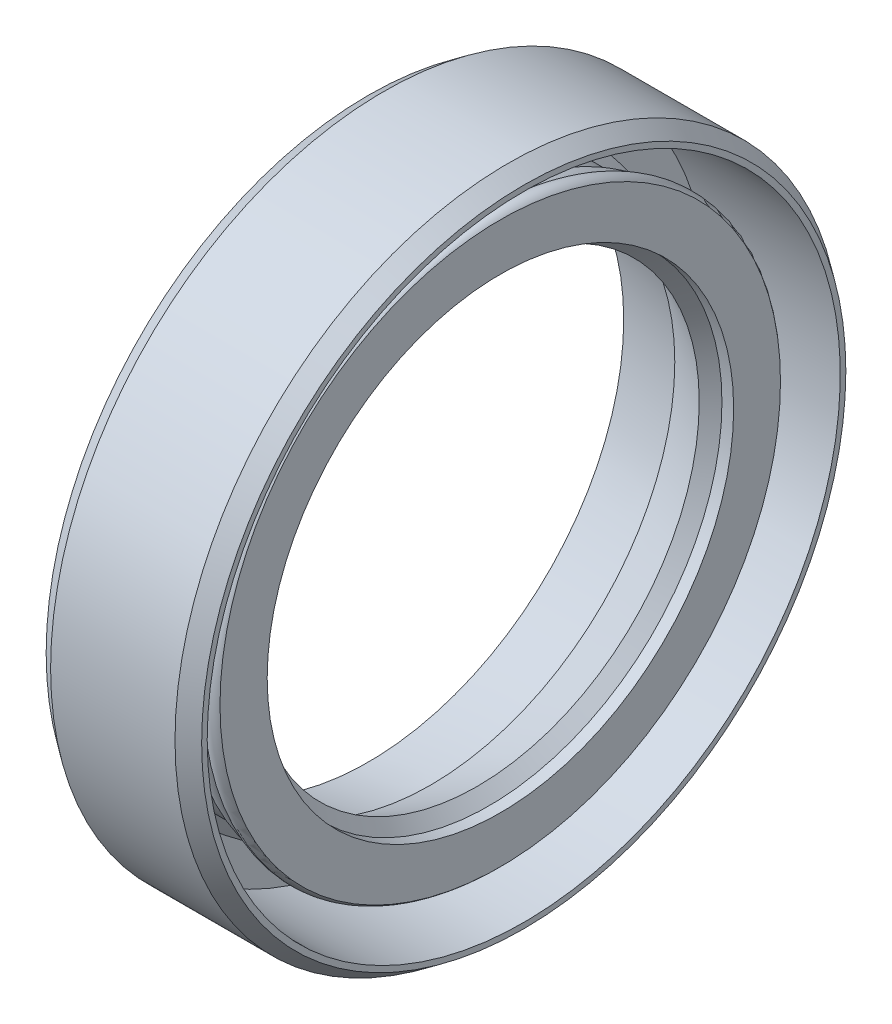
ISO-10303-21;
HEADER;
FILE_DESCRIPTION(('STEP AP214'),'2;1');
FILE_NAME('part.step','',(''),(''),'','','');
FILE_SCHEMA(('AUTOMOTIVE_DESIGN { 1 0 10303 214 1 1 1 1 }'));
ENDSEC;
DATA;
#1=APPLICATION_CONTEXT('core data for automotive mechanical design processes');
#2=APPLICATION_PROTOCOL_DEFINITION('international standard','automotive_design',2000,#1);
#3=PRODUCT_CONTEXT('',#1,'mechanical');
#4=PRODUCT('Part','Part','',(#3));
#5=PRODUCT_RELATED_PRODUCT_CATEGORY('part','',(#4));
#6=PRODUCT_DEFINITION_FORMATION('','',#4);
#7=PRODUCT_DEFINITION_CONTEXT('part definition',#1,'design');
#8=PRODUCT_DEFINITION('design','',#6,#7);
#9=PRODUCT_DEFINITION_SHAPE('','',#8);
#10=(LENGTH_UNIT() NAMED_UNIT(*) SI_UNIT(.MILLI.,.METRE.));
#11=(NAMED_UNIT(*) PLANE_ANGLE_UNIT() SI_UNIT($,.RADIAN.));
#12=(NAMED_UNIT(*) SI_UNIT($,.STERADIAN.) SOLID_ANGLE_UNIT());
#13=UNCERTAINTY_MEASURE_WITH_UNIT(LENGTH_MEASURE(1.E-05),#10,'distance_accuracy_value','');
#14=(GEOMETRIC_REPRESENTATION_CONTEXT(3) GLOBAL_UNCERTAINTY_ASSIGNED_CONTEXT((#13)) GLOBAL_UNIT_ASSIGNED_CONTEXT((#10,
#11,#12)) REPRESENTATION_CONTEXT('',''));
#15=CARTESIAN_POINT('',(0.,0.,0.));
#16=DIRECTION('',(0.,0.,1.));
#17=DIRECTION('',(1.,0.,0.));
#18=AXIS2_PLACEMENT_3D('',#15,#16,#17);
#19=CARTESIAN_POINT('',(7.00000000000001,0.,0.));
#20=DIRECTION('',(-1.,0.,0.));
#21=DIRECTION('',(0.,0.,1.));
#22=AXIS2_PLACEMENT_3D('',#19,#20,#21);
#23=CYLINDRICAL_SURFACE('',#22,15.);
#24=CARTESIAN_POINT('',(0.700000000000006,0.,0.));
#25=DIRECTION('',(-1.,0.,0.));
#26=DIRECTION('',(0.,0.,1.));
#27=AXIS2_PLACEMENT_3D('',#24,#25,#26);
#28=CIRCLE('',#27,15.);
#29=CARTESIAN_POINT('',(0.700000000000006,0.,15.));
#30=VERTEX_POINT('',#29);
#31=EDGE_CURVE('E10',#30,#30,#28,.T.);
#32=ORIENTED_EDGE('',*,*,#31,.F.);
#33=EDGE_LOOP('',(#32));
#34=FACE_BOUND('',#33,.T.);
#35=CARTESIAN_POINT('',(6.3,0.,0.));
#36=DIRECTION('',(-1.,0.,0.));
#37=DIRECTION('',(0.,0.,1.));
#38=AXIS2_PLACEMENT_3D('',#35,#36,#37);
#39=CIRCLE('',#38,15.);
#40=CARTESIAN_POINT('',(6.3,0.,15.));
#41=VERTEX_POINT('',#40);
#42=EDGE_CURVE('E72',#41,#41,#39,.T.);
#43=ORIENTED_EDGE('',*,*,#42,.T.);
#44=EDGE_LOOP('',(#43));
#45=FACE_BOUND('',#44,.T.);
#46=ADVANCED_FACE('F14',(#34,#45),#23,.T.);
#47=CARTESIAN_POINT('',(0.700000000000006,0.,0.));
#48=DIRECTION('',(1.,0.,0.));
#49=DIRECTION('',(0.,0.,-1.));
#50=AXIS2_PLACEMENT_3D('',#47,#48,#49);
#51=CONICAL_SURFACE('',#50,15.,0.620249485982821);
#52=CARTESIAN_POINT('',(0.,0.,0.));
#53=DIRECTION('',(-1.,0.,0.));
#54=DIRECTION('',(0.,0.,1.));
#55=AXIS2_PLACEMENT_3D('',#52,#53,#54);
#56=CIRCLE('',#55,14.5);
#57=CARTESIAN_POINT('',(0.,0.,14.5));
#58=VERTEX_POINT('',#57);
#59=EDGE_CURVE('E20',#58,#58,#56,.T.);
#60=ORIENTED_EDGE('',*,*,#59,.F.);
#61=EDGE_LOOP('',(#60));
#62=FACE_BOUND('',#61,.T.);
#63=ORIENTED_EDGE('',*,*,#31,.T.);
#64=EDGE_LOOP('',(#63));
#65=FACE_BOUND('',#64,.T.);
#66=ADVANCED_FACE('F169',(#62,#65),#51,.T.);
#67=CARTESIAN_POINT('',(0.,14.5,0.));
#68=DIRECTION('',(1.,0.,0.));
#69=DIRECTION('',(0.,0.,-1.));
#70=AXIS2_PLACEMENT_3D('',#67,#68,#69);
#71=PLANE('',#70);
#72=CARTESIAN_POINT('',(0.,0.,0.));
#73=DIRECTION('',(-1.,0.,0.));
#74=DIRECTION('',(0.,0.,1.));
#75=AXIS2_PLACEMENT_3D('',#72,#73,#74);
#76=CIRCLE('',#75,11.5);
#77=CARTESIAN_POINT('',(0.,0.,11.5));
#78=VERTEX_POINT('',#77);
#79=EDGE_CURVE('E24',#78,#78,#76,.T.);
#80=ORIENTED_EDGE('',*,*,#79,.F.);
#81=EDGE_LOOP('',(#80));
#82=FACE_BOUND('',#81,.T.);
#83=ORIENTED_EDGE('',*,*,#59,.T.);
#84=EDGE_LOOP('',(#83));
#85=FACE_BOUND('',#84,.T.);
#86=ADVANCED_FACE('F164',(#82,#85),#71,.F.);
#87=CARTESIAN_POINT('',(0.,0.,0.));
#88=DIRECTION('',(-1.,0.,0.));
#89=DIRECTION('',(0.,0.,1.));
#90=AXIS2_PLACEMENT_3D('',#87,#88,#89);
#91=CONICAL_SURFACE('',#90,11.5,0.176708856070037);
#92=CARTESIAN_POINT('',(2.8,0.,0.));
#93=DIRECTION('',(-1.,0.,0.));
#94=DIRECTION('',(0.,0.,1.));
#95=AXIS2_PLACEMENT_3D('',#92,#93,#94);
#96=CIRCLE('',#95,11.);
#97=CARTESIAN_POINT('',(2.8,0.,11.));
#98=VERTEX_POINT('',#97);
#99=EDGE_CURVE('E28',#98,#98,#96,.T.);
#100=ORIENTED_EDGE('',*,*,#99,.F.);
#101=EDGE_LOOP('',(#100));
#102=FACE_BOUND('',#101,.T.);
#103=ORIENTED_EDGE('',*,*,#79,.T.);
#104=EDGE_LOOP('',(#103));
#105=FACE_BOUND('',#104,.T.);
#106=ADVANCED_FACE('F158',(#102,#105),#91,.F.);
#107=CARTESIAN_POINT('',(3.84999999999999,0.,0.));
#108=DIRECTION('',(-1.,0.,0.));
#109=DIRECTION('',(0.,0.,1.));
#110=AXIS2_PLACEMENT_3D('',#107,#108,#109);
#111=CONICAL_SURFACE('',#110,10.5,0.444419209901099);
#112=CARTESIAN_POINT('',(4.9,0.,0.));
#113=DIRECTION('',(-1.,0.,0.));
#114=DIRECTION('',(0.,0.,1.));
#115=AXIS2_PLACEMENT_3D('',#112,#113,#114);
#116=CIRCLE('',#115,10.);
#117=CARTESIAN_POINT('',(4.9,0.,10.));
#118=VERTEX_POINT('',#117);
#119=EDGE_CURVE('E33',#118,#118,#116,.T.);
#120=ORIENTED_EDGE('',*,*,#119,.F.);
#121=EDGE_LOOP('',(#120));
#122=FACE_BOUND('',#121,.T.);
#123=ORIENTED_EDGE('',*,*,#99,.T.);
#124=EDGE_LOOP('',(#123));
#125=FACE_BOUND('',#124,.T.);
#126=ADVANCED_FACE('F152',(#122,#125),#111,.F.);
#127=CARTESIAN_POINT('',(4.9,0.,0.));
#128=DIRECTION('',(1.,0.,0.));
#129=DIRECTION('',(0.,0.,-1.));
#130=AXIS2_PLACEMENT_3D('',#127,#128,#129);
#131=CONICAL_SURFACE('',#130,10.,0.758824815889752);
#132=CARTESIAN_POINT('',(5.42500453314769,0.,0.));
#133=DIRECTION('',(-1.,0.,0.));
#134=DIRECTION('',(0.,0.,1.));
#135=AXIS2_PLACEMENT_3D('',#132,#133,#134);
#136=CIRCLE('',#135,10.4978183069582);
#137=CARTESIAN_POINT('',(5.42500453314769,0.,10.4978183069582));
#138=VERTEX_POINT('',#137);
#139=EDGE_CURVE('E36',#138,#138,#136,.T.);
#140=ORIENTED_EDGE('',*,*,#139,.F.);
#141=EDGE_LOOP('',(#140));
#142=FACE_BOUND('',#141,.T.);
#143=ORIENTED_EDGE('',*,*,#119,.T.);
#144=EDGE_LOOP('',(#143));
#145=FACE_BOUND('',#144,.T.);
#146=ADVANCED_FACE('F146',(#142,#145),#131,.F.);
#147=CARTESIAN_POINT('',(5.42500453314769,0.,0.));
#148=DIRECTION('',(1.,0.,0.));
#149=DIRECTION('',(0.,0.,-1.));
#150=AXIS2_PLACEMENT_3D('',#147,#148,#149);
#151=CONICAL_SURFACE('',#150,10.4978183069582,0.00415561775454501);
#152=CARTESIAN_POINT('',(5.95,0.,0.));
#153=DIRECTION('',(-1.,0.,0.));
#154=DIRECTION('',(0.,0.,1.));
#155=AXIS2_PLACEMENT_3D('',#152,#153,#154);
#156=CIRCLE('',#155,10.5);
#157=CARTESIAN_POINT('',(5.95,0.,10.5));
#158=VERTEX_POINT('',#157);
#159=EDGE_CURVE('E39',#158,#158,#156,.T.);
#160=ORIENTED_EDGE('',*,*,#159,.F.);
#161=EDGE_LOOP('',(#160));
#162=FACE_BOUND('',#161,.T.);
#163=ORIENTED_EDGE('',*,*,#139,.T.);
#164=EDGE_LOOP('',(#163));
#165=FACE_BOUND('',#164,.T.);
#166=ADVANCED_FACE('F140',(#162,#165),#151,.F.);
#167=CARTESIAN_POINT('',(5.95,0.,0.));
#168=DIRECTION('',(-1.,0.,0.));
#169=DIRECTION('',(0.,0.,1.));
#170=AXIS2_PLACEMENT_3D('',#167,#168,#169);
#171=CONICAL_SURFACE('',#170,10.5,1.56664070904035);
#172=CARTESIAN_POINT('',(5.94120580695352,0.,0.));
#173=DIRECTION('',(-1.,0.,0.));
#174=DIRECTION('',(0.,0.,1.));
#175=AXIS2_PLACEMENT_3D('',#172,#173,#174);
#176=CIRCLE('',#175,12.6162058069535);
#177=CARTESIAN_POINT('',(5.94120580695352,0.,12.6162058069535));
#178=VERTEX_POINT('',#177);
#179=EDGE_CURVE('E42',#178,#178,#176,.T.);
#180=ORIENTED_EDGE('',*,*,#179,.F.);
#181=EDGE_LOOP('',(#180));
#182=FACE_BOUND('',#181,.T.);
#183=ORIENTED_EDGE('',*,*,#159,.T.);
#184=EDGE_LOOP('',(#183));
#185=FACE_BOUND('',#184,.T.);
#186=ADVANCED_FACE('F134',(#182,#185),#171,.T.);
#187=CARTESIAN_POINT('',(5.56997474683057,0.,0.));
#188=DIRECTION('',(-1.,0.,0.));
#189=DIRECTION('',(0.,0.,1.));
#190=AXIS2_PLACEMENT_3D('',#187,#188,#189);
#191=TOROIDAL_SURFACE('',#190,12.2449747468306,0.525);
#192=CARTESIAN_POINT('',(5.04497474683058,0.,0.));
#193=DIRECTION('',(-1.,0.,0.));
#194=DIRECTION('',(0.,0.,1.));
#195=AXIS2_PLACEMENT_3D('',#192,#193,#194);
#196=CIRCLE('',#195,12.2449747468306);
#197=CARTESIAN_POINT('',(5.04497474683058,0.,12.2449747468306));
#198=VERTEX_POINT('',#197);
#199=EDGE_CURVE('E45',#198,#198,#196,.T.);
#200=ORIENTED_EDGE('',*,*,#199,.F.);
#201=EDGE_LOOP('',(#200));
#202=FACE_BOUND('',#201,.T.);
#203=ORIENTED_EDGE('',*,*,#179,.T.);
#204=EDGE_LOOP('',(#203));
#205=FACE_BOUND('',#204,.T.);
#206=ADVANCED_FACE('F128',(#202,#205),#191,.T.);
#207=CARTESIAN_POINT('',(4.55,0.,0.));
#208=DIRECTION('',(-1.,0.,0.));
#209=DIRECTION('',(0.,0.,1.));
#210=AXIS2_PLACEMENT_3D('',#207,#208,#209);
#211=TOROIDAL_SURFACE('',#210,11.75,0.7);
#212=CARTESIAN_POINT('',(3.84999999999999,0.,0.));
#213=DIRECTION('',(-1.,0.,0.));
#214=DIRECTION('',(0.,0.,1.));
#215=AXIS2_PLACEMENT_3D('',#212,#213,#214);
#216=CIRCLE('',#215,11.75);
#217=CARTESIAN_POINT('',(3.84999999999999,0.,11.75));
#218=VERTEX_POINT('',#217);
#219=EDGE_CURVE('E48',#218,#218,#216,.T.);
#220=ORIENTED_EDGE('',*,*,#219,.F.);
#221=EDGE_LOOP('',(#220));
#222=FACE_BOUND('',#221,.T.);
#223=ORIENTED_EDGE('',*,*,#199,.T.);
#224=EDGE_LOOP('',(#223));
#225=FACE_BOUND('',#224,.T.);
#226=ADVANCED_FACE('F122',(#222,#225),#211,.T.);
#227=CARTESIAN_POINT('',(3.84999999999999,0.,0.));
#228=DIRECTION('',(-1.,0.,0.));
#229=DIRECTION('',(0.,0.,1.));
#230=AXIS2_PLACEMENT_3D('',#227,#228,#229);
#231=CONICAL_SURFACE('',#230,11.75,0.620249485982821);
#232=CARTESIAN_POINT('',(3.5,0.,0.));
#233=DIRECTION('',(-1.,0.,0.));
#234=DIRECTION('',(0.,0.,1.));
#235=AXIS2_PLACEMENT_3D('',#232,#233,#234);
#236=CIRCLE('',#235,12.);
#237=CARTESIAN_POINT('',(3.5,0.,12.));
#238=VERTEX_POINT('',#237);
#239=EDGE_CURVE('E51',#238,#238,#236,.T.);
#240=ORIENTED_EDGE('',*,*,#239,.F.);
#241=EDGE_LOOP('',(#240));
#242=FACE_BOUND('',#241,.T.);
#243=ORIENTED_EDGE('',*,*,#219,.T.);
#244=EDGE_LOOP('',(#243));
#245=FACE_BOUND('',#244,.T.);
#246=ADVANCED_FACE('F116',(#242,#245),#231,.T.);
#247=CARTESIAN_POINT('',(7.00000000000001,0.,0.));
#248=DIRECTION('',(-1.,0.,0.));
#249=DIRECTION('',(0.,0.,1.));
#250=AXIS2_PLACEMENT_3D('',#247,#248,#249);
#251=CYLINDRICAL_SURFACE('',#250,12.);
#252=CARTESIAN_POINT('',(1.75,0.,0.));
#253=DIRECTION('',(-1.,0.,0.));
#254=DIRECTION('',(0.,0.,1.));
#255=AXIS2_PLACEMENT_3D('',#252,#253,#254);
#256=CIRCLE('',#255,12.);
#257=CARTESIAN_POINT('',(1.75,0.,12.));
#258=VERTEX_POINT('',#257);
#259=EDGE_CURVE('E54',#258,#258,#256,.T.);
#260=ORIENTED_EDGE('',*,*,#259,.F.);
#261=EDGE_LOOP('',(#260));
#262=FACE_BOUND('',#261,.T.);
#263=ORIENTED_EDGE('',*,*,#239,.T.);
#264=EDGE_LOOP('',(#263));
#265=FACE_BOUND('',#264,.T.);
#266=ADVANCED_FACE('F110',(#262,#265),#251,.T.);
#267=CARTESIAN_POINT('',(1.75,0.,0.));
#268=DIRECTION('',(-1.,0.,0.));
#269=DIRECTION('',(0.,0.,1.));
#270=AXIS2_PLACEMENT_3D('',#267,#268,#269);
#271=CONICAL_SURFACE('',#270,12.,0.960070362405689);
#272=CARTESIAN_POINT('',(1.4,0.,0.));
#273=DIRECTION('',(-1.,0.,0.));
#274=DIRECTION('',(0.,0.,1.));
#275=AXIS2_PLACEMENT_3D('',#272,#273,#274);
#276=CIRCLE('',#275,12.5);
#277=CARTESIAN_POINT('',(1.4,0.,12.5));
#278=VERTEX_POINT('',#277);
#279=EDGE_CURVE('E57',#278,#278,#276,.T.);
#280=ORIENTED_EDGE('',*,*,#279,.F.);
#281=EDGE_LOOP('',(#280));
#282=FACE_BOUND('',#281,.T.);
#283=ORIENTED_EDGE('',*,*,#259,.T.);
#284=EDGE_LOOP('',(#283));
#285=FACE_BOUND('',#284,.T.);
#286=ADVANCED_FACE('F104',(#282,#285),#271,.T.);
#287=CARTESIAN_POINT('',(7.00000000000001,0.,0.));
#288=DIRECTION('',(-1.,0.,0.));
#289=DIRECTION('',(0.,0.,1.));
#290=AXIS2_PLACEMENT_3D('',#287,#288,#289);
#291=CYLINDRICAL_SURFACE('',#290,12.5);
#292=CARTESIAN_POINT('',(1.05,0.,0.));
#293=DIRECTION('',(-1.,0.,0.));
#294=DIRECTION('',(0.,0.,1.));
#295=AXIS2_PLACEMENT_3D('',#292,#293,#294);
#296=CIRCLE('',#295,12.5);
#297=CARTESIAN_POINT('',(1.05,0.,12.5));
#298=VERTEX_POINT('',#297);
#299=EDGE_CURVE('E60',#298,#298,#296,.T.);
#300=ORIENTED_EDGE('',*,*,#299,.F.);
#301=EDGE_LOOP('',(#300));
#302=FACE_BOUND('',#301,.T.);
#303=ORIENTED_EDGE('',*,*,#279,.T.);
#304=EDGE_LOOP('',(#303));
#305=FACE_BOUND('',#304,.T.);
#306=ADVANCED_FACE('F98',(#302,#305),#291,.T.);
#307=CARTESIAN_POINT('',(1.05,12.5,0.));
#308=DIRECTION('',(-1.,0.,0.));
#309=DIRECTION('',(0.,0.,1.));
#310=AXIS2_PLACEMENT_3D('',#307,#308,#309);
#311=PLANE('',#310);
#312=CARTESIAN_POINT('',(1.05,0.,0.));
#313=DIRECTION('',(-1.,0.,0.));
#314=DIRECTION('',(0.,0.,1.));
#315=AXIS2_PLACEMENT_3D('',#312,#313,#314);
#316=CIRCLE('',#315,14.25);
#317=CARTESIAN_POINT('',(1.05,0.,14.25));
#318=VERTEX_POINT('',#317);
#319=EDGE_CURVE('E63',#318,#318,#316,.T.);
#320=ORIENTED_EDGE('',*,*,#319,.F.);
#321=EDGE_LOOP('',(#320));
#322=FACE_BOUND('',#321,.T.);
#323=ORIENTED_EDGE('',*,*,#299,.T.);
#324=EDGE_LOOP('',(#323));
#325=FACE_BOUND('',#324,.T.);
#326=ADVANCED_FACE('F92',(#322,#325),#311,.F.);
#327=CARTESIAN_POINT('',(7.00000000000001,0.,0.));
#328=DIRECTION('',(-1.,0.,0.));
#329=DIRECTION('',(0.,0.,1.));
#330=AXIS2_PLACEMENT_3D('',#327,#328,#329);
#331=CYLINDRICAL_SURFACE('',#330,14.25);
#332=CARTESIAN_POINT('',(7.00000000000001,0.,0.));
#333=DIRECTION('',(-1.,0.,0.));
#334=DIRECTION('',(0.,0.,1.));
#335=AXIS2_PLACEMENT_3D('',#332,#333,#334);
#336=CIRCLE('',#335,14.25);
#337=CARTESIAN_POINT('',(7.00000000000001,0.,14.25));
#338=VERTEX_POINT('',#337);
#339=EDGE_CURVE('E66',#338,#338,#336,.T.);
#340=ORIENTED_EDGE('',*,*,#339,.F.);
#341=EDGE_LOOP('',(#340));
#342=FACE_BOUND('',#341,.T.);
#343=ORIENTED_EDGE('',*,*,#319,.T.);
#344=EDGE_LOOP('',(#343));
#345=FACE_BOUND('',#344,.T.);
#346=ADVANCED_FACE('F86',(#342,#345),#331,.F.);
#347=CARTESIAN_POINT('',(6.99999999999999,14.25,0.));
#348=DIRECTION('',(-1.,0.,0.));
#349=DIRECTION('',(0.,0.,1.));
#350=AXIS2_PLACEMENT_3D('',#347,#348,#349);
#351=PLANE('',#350);
#352=CARTESIAN_POINT('',(7.00000000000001,0.,0.));
#353=DIRECTION('',(-1.,0.,0.));
#354=DIRECTION('',(0.,0.,1.));
#355=AXIS2_PLACEMENT_3D('',#352,#353,#354);
#356=CIRCLE('',#355,14.5);
#357=CARTESIAN_POINT('',(7.00000000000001,0.,14.5));
#358=VERTEX_POINT('',#357);
#359=EDGE_CURVE('E69',#358,#358,#356,.T.);
#360=ORIENTED_EDGE('',*,*,#359,.F.);
#361=EDGE_LOOP('',(#360));
#362=FACE_BOUND('',#361,.T.);
#363=ORIENTED_EDGE('',*,*,#339,.T.);
#364=EDGE_LOOP('',(#363));
#365=FACE_BOUND('',#364,.T.);
#366=ADVANCED_FACE('F80',(#362,#365),#351,.F.);
#367=CARTESIAN_POINT('',(7.00000000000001,0.,0.));
#368=DIRECTION('',(-1.,0.,0.));
#369=DIRECTION('',(0.,0.,1.));
#370=AXIS2_PLACEMENT_3D('',#367,#368,#369);
#371=CONICAL_SURFACE('',#370,14.5,0.620249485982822);
#372=ORIENTED_EDGE('',*,*,#42,.F.);
#373=EDGE_LOOP('',(#372));
#374=FACE_BOUND('',#373,.T.);
#375=ORIENTED_EDGE('',*,*,#359,.T.);
#376=EDGE_LOOP('',(#375));
#377=FACE_BOUND('',#376,.T.);
#378=ADVANCED_FACE('F77',(#374,#377),#371,.T.);
#379=CLOSED_SHELL('',(#46,#66,#86,#106,#126,#146,#166,#186,#206,#226,#246,#266,#286,#306,#326,
#346,#366,#378));
#380=MANIFOLD_SOLID_BREP('B1',#379);
#381=ADVANCED_BREP_SHAPE_REPRESENTATION('',(#18,#380),#14);
#382=SHAPE_DEFINITION_REPRESENTATION(#9,#381);
ENDSEC;
END-ISO-10303-21;
